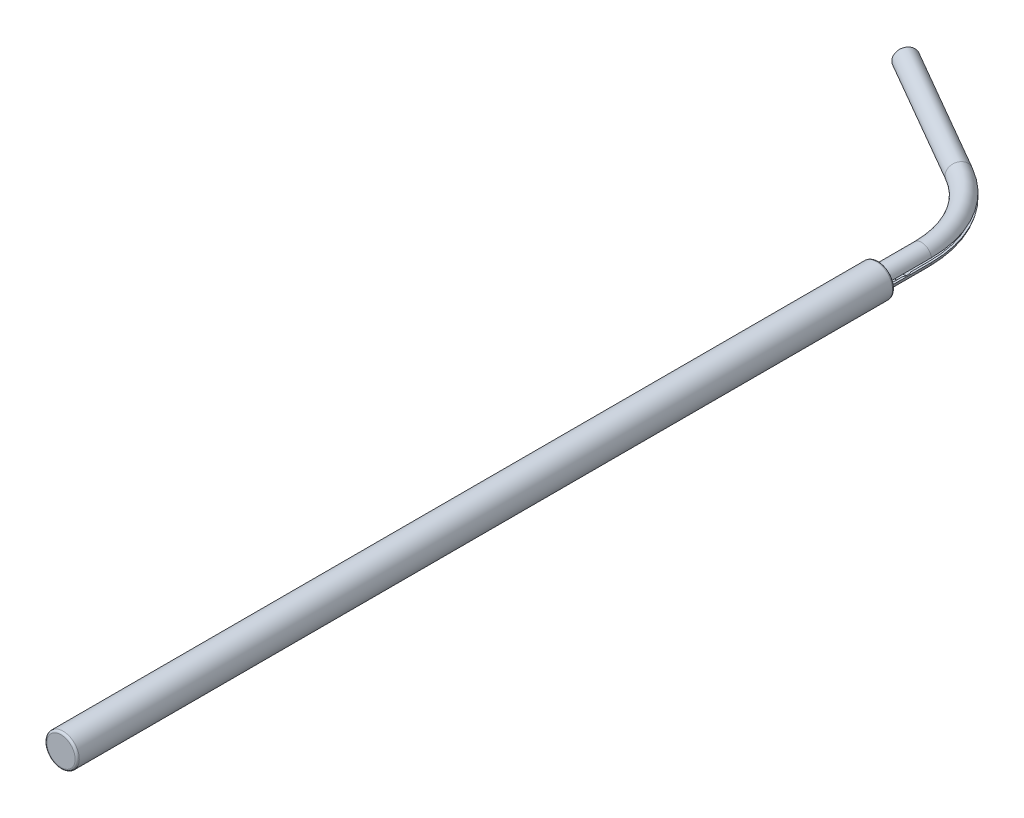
from build123d import *

# Parameters (mm, degrees)
SKETCH1_R      = 3.96875
EXTRUDE1_DEPTH = 200
FILLET1_R      = 0.508


with BuildPart() as part:
    # Sketch1 → Extrude1 (new body)
    with BuildSketch(Plane.XY):
        Circle(SKETCH1_R)
    extrude(amount=-EXTRUDE1_DEPTH)

    # Fillet1
    fillet1_edges = [part.edges().sort_by_distance(p)[0] for p in [
        (-3.96875, 0, 0),
        (-3.96875, 0, -200),
    ]]
    fillet(fillet1_edges, radius=FILLET1_R)

    # Sweep1: sweep along a path in Sketch2
    with BuildLine(Plane(origin=(0, 0, 0), x_dir=(1, 0, 0), z_dir=(0, 1, 0))) as sweep1_path:
        Line((0, 200), (0, 210.56624327))
        ThreePointArc((0, 210.56624327), (-3.349364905, 223.06624327), (-12.5, 232.216878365))
        Line((-12.5, 232.216878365), (-43.301270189, 250))
    # Sketch3 → Sweep1 (sweep)
    with BuildSketch(Plane(origin=(0, 0, -200), x_dir=(-1, 0, 0), z_dir=(0, 0, -1))):
        with BuildLine():
            Line((-2.449489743, 0.5), (-1.936491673, 0.5))
            ThreePointArc((-1.936491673, 0.5), (2, 0), (-1.936491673, -0.5))
            Line((-1.936491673, -0.5), (-2.449489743, -0.5))
            ThreePointArc((-2.449489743, -0.5), (2.5, 0), (-2.449489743, 0.5))
        make_face()
    sweep(path=sweep1_path.line)

    # Sketch4 → Cut-Revolve3 (revolve, cut)
    with BuildSketch(Plane(origin=(0, 0, -205), x_dir=(-1, 0, 0), z_dir=(0, 0, -1))):
        with BuildLine():
            Line((0, 2.25), (0, -2.25))
            ThreePointArc((0, -2.25), (2.25, 0), (0, 2.25))
        make_face()
    revolve(axis=Axis((0, 0, -205), (0, 1, 0)), mode=Mode.SUBTRACT)


solid = part.part
